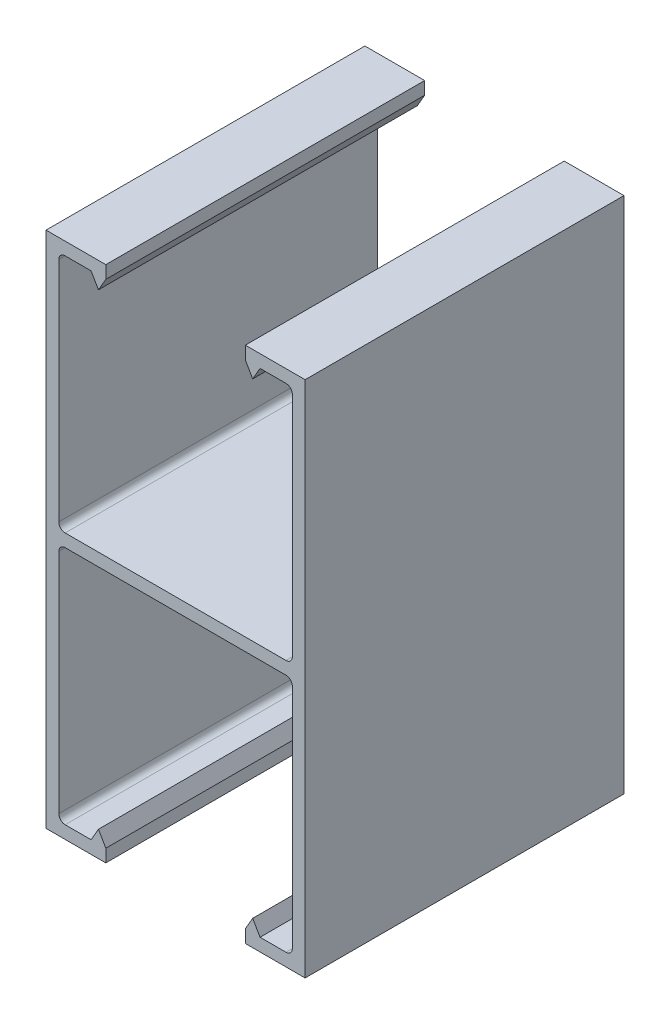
from build123d import *

# Parameters (mm, degrees)
BASE_EXTRUDE_DEPTH = 12.7


with BuildPart() as part:
    # Sketch1 → Base-Extrude (new, symmetric)
    with BuildSketch(Plane.XY):
        with BuildLine():
            Line((-5.55625, 20.6375), (-10.31875, 20.6375))
            Line((-10.31875, 20.6375), (-10.31875, -20.6375))
            Line((-10.31875, -20.6375), (-5.55625, -20.6375))
            Line((-5.55625, -20.6375), (-5.55625, -19.6215))
            Line((-5.55625, -19.6215), (-6.142837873, -18.6055))
            Line((-6.142837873, -18.6055), (-6.729425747, -19.6215))
            Line((-6.729425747, -19.6215), (-8.79475, -19.6215))
            ThreePointArc((-8.79475, -19.6215), (-9.153960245, -19.472710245), (-9.30275, -19.1135))
            Line((-9.30275, -19.1135), (-9.30275, -1.016))
            ThreePointArc((-9.30275, -1.016), (-9.153960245, -0.656789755), (-8.79475, -0.508))
            Line((-8.79475, -0.508), (8.79475, -0.508))
            ThreePointArc((8.79475, -0.508), (9.153960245, -0.656789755), (9.30275, -1.016))
            Line((9.30275, -1.016), (9.30275, -19.1135))
            ThreePointArc((9.30275, -19.1135), (9.153960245, -19.472710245), (8.79475, -19.6215))
            Line((8.79475, -19.6215), (6.729425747, -19.6215))
            Line((6.729425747, -19.6215), (6.142837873, -18.6055))
            Line((6.142837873, -18.6055), (5.55625, -19.6215))
            Line((5.55625, -19.6215), (5.55625, -20.6375))
            Line((5.55625, -20.6375), (10.31875, -20.6375))
            Line((10.31875, -20.6375), (10.31875, 20.6375))
            Line((10.31875, 20.6375), (5.55625, 20.6375))
            Line((5.55625, 20.6375), (5.55625, 19.6215))
            Line((5.55625, 19.6215), (6.142837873, 18.6055))
            Line((6.142837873, 18.6055), (6.729425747, 19.6215))
            Line((6.729425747, 19.6215), (8.79475, 19.6215))
            ThreePointArc((8.79475, 19.6215), (9.153960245, 19.472710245), (9.30275, 19.1135))
            Line((9.30275, 19.1135), (9.30275, 1.016))
            ThreePointArc((9.30275, 1.016), (9.153960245, 0.656789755), (8.79475, 0.508))
            Line((8.79475, 0.508), (-8.79475, 0.508))
            ThreePointArc((-8.79475, 0.508), (-9.153960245, 0.656789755), (-9.30275, 1.016))
            Line((-9.30275, 1.016), (-9.30275, 19.1135))
            ThreePointArc((-9.30275, 19.1135), (-9.153960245, 19.472710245), (-8.79475, 19.6215))
            Line((-8.79475, 19.6215), (-6.729425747, 19.6215))
            Line((-6.729425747, 19.6215), (-6.142837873, 18.6055))
            Line((-6.142837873, 18.6055), (-5.55625, 19.6215))
            Line((-5.55625, 19.6215), (-5.55625, 20.6375))
        make_face()
    extrude(amount=BASE_EXTRUDE_DEPTH, both=True)


solid = part.part
